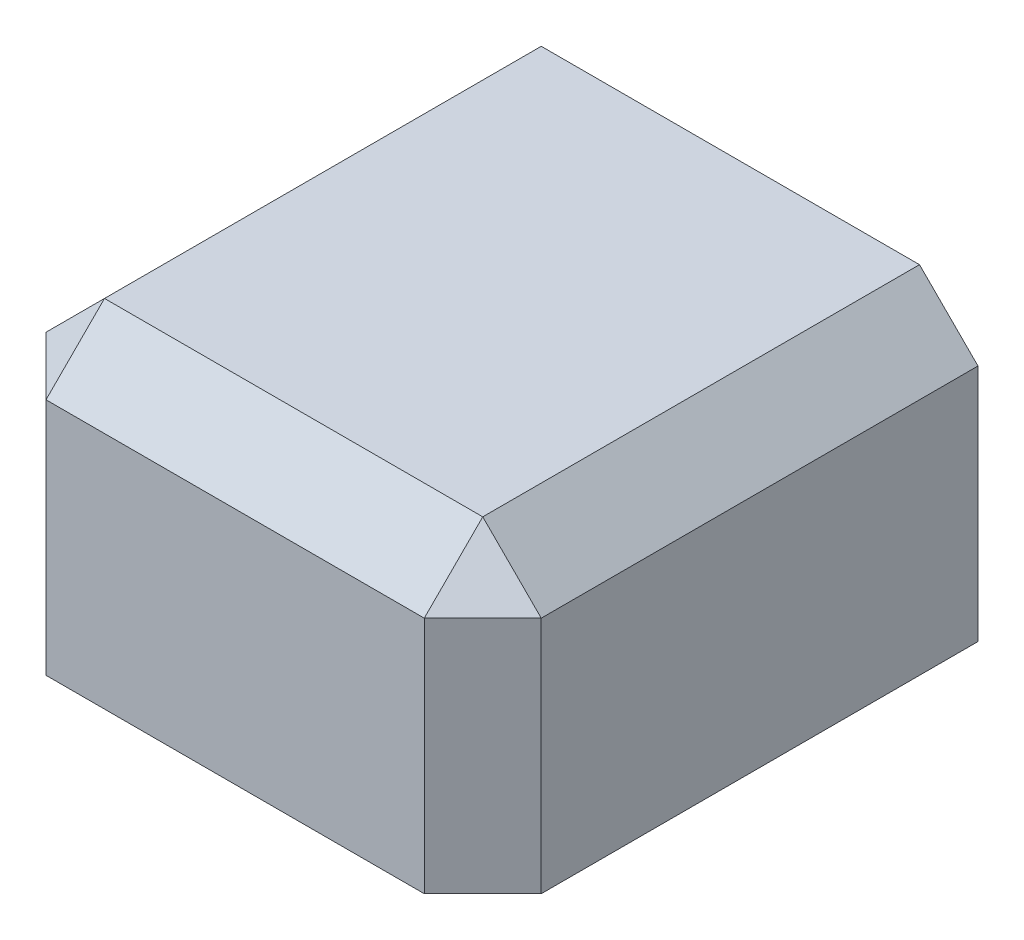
ISO-10303-21;
HEADER;
FILE_DESCRIPTION(('STEP AP214'),'2;1');
FILE_NAME('part.step','',(''),(''),'','','');
FILE_SCHEMA(('AUTOMOTIVE_DESIGN { 1 0 10303 214 1 1 1 1 }'));
ENDSEC;
DATA;
#1=APPLICATION_CONTEXT('core data for automotive mechanical design processes');
#2=APPLICATION_PROTOCOL_DEFINITION('international standard','automotive_design',2000,#1);
#3=PRODUCT_CONTEXT('',#1,'mechanical');
#4=PRODUCT('Part','Part','',(#3));
#5=PRODUCT_RELATED_PRODUCT_CATEGORY('part','',(#4));
#6=PRODUCT_DEFINITION_FORMATION('','',#4);
#7=PRODUCT_DEFINITION_CONTEXT('part definition',#1,'design');
#8=PRODUCT_DEFINITION('design','',#6,#7);
#9=PRODUCT_DEFINITION_SHAPE('','',#8);
#10=(LENGTH_UNIT() NAMED_UNIT(*) SI_UNIT(.MILLI.,.METRE.));
#11=(NAMED_UNIT(*) PLANE_ANGLE_UNIT() SI_UNIT($,.RADIAN.));
#12=(NAMED_UNIT(*) SI_UNIT($,.STERADIAN.) SOLID_ANGLE_UNIT());
#13=UNCERTAINTY_MEASURE_WITH_UNIT(LENGTH_MEASURE(1.E-05),#10,'distance_accuracy_value','');
#14=(GEOMETRIC_REPRESENTATION_CONTEXT(3) GLOBAL_UNCERTAINTY_ASSIGNED_CONTEXT((#13)) GLOBAL_UNIT_ASSIGNED_CONTEXT((#10,
#11,#12)) REPRESENTATION_CONTEXT('',''));
#15=CARTESIAN_POINT('',(0.,0.,0.));
#16=DIRECTION('',(0.,0.,1.));
#17=DIRECTION('',(1.,0.,0.));
#18=AXIS2_PLACEMENT_3D('',#15,#16,#17);
#19=CARTESIAN_POINT('',(-63.5,76.2,-63.5));
#20=DIRECTION('',(0.,0.,1.));
#21=DIRECTION('',(1.,0.,0.));
#22=AXIS2_PLACEMENT_3D('',#19,#20,#21);
#23=PLANE('',#22);
#24=DIRECTION('',(-0.258819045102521,-0.965925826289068,0.));
#25=VECTOR('',#24,1.);
#26=CARTESIAN_POINT('',(-14.826846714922,63.1580678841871,-63.5));
#27=LINE('',#26,#25);
#28=CARTESIAN_POINT('',(-31.75,0.,-63.5));
#29=VERTEX_POINT('',#28);
#30=CARTESIAN_POINT('',(-26.6455678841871,19.05,-63.5));
#31=VERTEX_POINT('',#30);
#32=EDGE_CURVE('E186',#29,#31,#27,.F.);
#33=ORIENTED_EDGE('',*,*,#32,.F.);
#34=DIRECTION('',(-1.,0.,0.));
#35=VECTOR('',#34,1.);
#36=CARTESIAN_POINT('',(-63.5,0.,-63.5));
#37=LINE('',#36,#35);
#38=CARTESIAN_POINT('',(-63.5,0.,-63.5));
#39=VERTEX_POINT('',#38);
#40=EDGE_CURVE('E163',#29,#39,#37,.T.);
#41=ORIENTED_EDGE('',*,*,#40,.T.);
#42=DIRECTION('',(0.,-1.,0.));
#43=VECTOR('',#42,1.);
#44=CARTESIAN_POINT('',(-63.5,76.2,-63.5));
#45=LINE('',#44,#43);
#46=CARTESIAN_POINT('',(-63.5,61.2,-63.5));
#47=VERTEX_POINT('',#46);
#48=EDGE_CURVE('E216',#47,#39,#45,.T.);
#49=ORIENTED_EDGE('',*,*,#48,.F.);
#50=DIRECTION('',(0.707106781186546,0.70710678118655,0.));
#51=VECTOR('',#50,1.);
#52=CARTESIAN_POINT('',(-48.5000000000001,76.2,-63.5));
#53=LINE('',#52,#51);
#54=CARTESIAN_POINT('',(-48.5000000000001,76.2,-63.5));
#55=VERTEX_POINT('',#54);
#56=EDGE_CURVE('E189',#47,#55,#53,.T.);
#57=ORIENTED_EDGE('',*,*,#56,.T.);
#58=DIRECTION('',(-1.,0.,0.));
#59=VECTOR('',#58,1.);
#60=CARTESIAN_POINT('',(-63.5,76.2,-63.5));
#61=LINE('',#60,#59);
#62=CARTESIAN_POINT('',(48.5,76.2,-63.5));
#63=VERTEX_POINT('',#62);
#64=EDGE_CURVE('E219',#63,#55,#61,.T.);
#65=ORIENTED_EDGE('',*,*,#64,.F.);
#66=DIRECTION('',(0.707106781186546,-0.70710678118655,0.));
#67=VECTOR('',#66,1.);
#68=CARTESIAN_POINT('',(48.5,76.2,-63.5));
#69=LINE('',#68,#67);
#70=CARTESIAN_POINT('',(63.5,61.2,-63.5));
#71=VERTEX_POINT('',#70);
#72=EDGE_CURVE('E191',#63,#71,#69,.T.);
#73=ORIENTED_EDGE('',*,*,#72,.T.);
#74=DIRECTION('',(0.,-1.,0.));
#75=VECTOR('',#74,1.);
#76=CARTESIAN_POINT('',(63.5,76.2,-63.5));
#77=LINE('',#76,#75);
#78=CARTESIAN_POINT('',(63.5,0.,-63.5));
#79=VERTEX_POINT('',#78);
#80=EDGE_CURVE('E214',#71,#79,#77,.T.);
#81=ORIENTED_EDGE('',*,*,#80,.T.);
#82=CARTESIAN_POINT('',(31.75,0.,-63.5));
#83=VERTEX_POINT('',#82);
#84=EDGE_CURVE('E226',#79,#83,#37,.T.);
#85=ORIENTED_EDGE('',*,*,#84,.T.);
#86=DIRECTION('',(-0.258819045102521,0.965925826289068,0.));
#87=VECTOR('',#86,1.);
#88=CARTESIAN_POINT('',(6.3194598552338,94.9080678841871,-63.5));
#89=LINE('',#88,#87);
#90=CARTESIAN_POINT('',(26.8939654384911,18.1229677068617,-63.5));
#91=VERTEX_POINT('',#90);
#92=EDGE_CURVE('E58',#91,#83,#89,.F.);
#93=ORIENTED_EDGE('',*,*,#92,.F.);
#94=DIRECTION('',(0.999682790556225,-0.0251856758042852,0.));
#95=VECTOR('',#94,1.);
#96=CARTESIAN_POINT('',(-64.904906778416,20.4357179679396,-63.5));
#97=LINE('',#96,#95);
#98=CARTESIAN_POINT('',(-9.90227687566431,19.05,-63.5000000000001));
#99=VERTEX_POINT('',#98);
#100=EDGE_CURVE('E51',#99,#91,#97,.T.);
#101=ORIENTED_EDGE('',*,*,#100,.F.);
#102=DIRECTION('',(1.,0.,0.));
#103=VECTOR('',#102,1.);
#104=CARTESIAN_POINT('',(-63.5,19.05,-63.5));
#105=LINE('',#104,#103);
#106=EDGE_CURVE('E11',#31,#99,#105,.T.);
#107=ORIENTED_EDGE('',*,*,#106,.F.);
#108=EDGE_LOOP('',(#33,#41,#49,#57,#65,#73,#81,#85,#93,#101,#107));
#109=FACE_BOUND('',#108,.T.);
#110=ADVANCED_FACE('F42',(#109),#23,.F.);
#111=CARTESIAN_POINT('',(0.,0.,0.));
#112=DIRECTION('',(0.,1.,0.));
#113=DIRECTION('',(0.,0.,1.));
#114=AXIS2_PLACEMENT_3D('',#111,#112,#113);
#115=PLANE('',#114);
#116=DIRECTION('',(0.,0.,1.));
#117=VECTOR('',#116,1.);
#118=CARTESIAN_POINT('',(-31.75,0.,0.));
#119=LINE('',#118,#117);
#120=CARTESIAN_POINT('',(-31.75,0.,0.));
#121=VERTEX_POINT('',#120);
#122=EDGE_CURVE('E143',#121,#29,#119,.F.);
#123=ORIENTED_EDGE('',*,*,#122,.F.);
#124=CARTESIAN_POINT('',(0.,0.,0.));
#125=DIRECTION('',(0.,1.,0.));
#126=DIRECTION('',(1.,0.,0.));
#127=AXIS2_PLACEMENT_3D('',#124,#125,#126);
#128=CIRCLE('',#127,31.75);
#129=CARTESIAN_POINT('',(31.75,0.,0.));
#130=VERTEX_POINT('',#129);
#131=EDGE_CURVE('E153',#121,#130,#128,.T.);
#132=ORIENTED_EDGE('',*,*,#131,.T.);
#133=DIRECTION('',(0.,0.,-1.));
#134=VECTOR('',#133,1.);
#135=CARTESIAN_POINT('',(31.75,0.,0.));
#136=LINE('',#135,#134);
#137=EDGE_CURVE('E157',#130,#83,#136,.T.);
#138=ORIENTED_EDGE('',*,*,#137,.T.);
#139=ORIENTED_EDGE('',*,*,#84,.F.);
#140=DIRECTION('',(0.,0.,-1.));
#141=VECTOR('',#140,1.);
#142=CARTESIAN_POINT('',(63.5,0.,-63.5));
#143=LINE('',#142,#141);
#144=CARTESIAN_POINT('',(63.5,0.,48.4999999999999));
#145=VERTEX_POINT('',#144);
#146=EDGE_CURVE('E171',#145,#79,#143,.T.);
#147=ORIENTED_EDGE('',*,*,#146,.F.);
#148=DIRECTION('',(0.707106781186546,0.,-0.707106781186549));
#149=VECTOR('',#148,1.);
#150=CARTESIAN_POINT('',(63.5,0.,48.4999999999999));
#151=LINE('',#150,#149);
#152=CARTESIAN_POINT('',(48.5,0.,63.5));
#153=VERTEX_POINT('',#152);
#154=EDGE_CURVE('E205',#145,#153,#151,.F.);
#155=ORIENTED_EDGE('',*,*,#154,.T.);
#156=DIRECTION('',(1.,0.,0.));
#157=VECTOR('',#156,1.);
#158=CARTESIAN_POINT('',(-63.5,0.,63.5));
#159=LINE('',#158,#157);
#160=CARTESIAN_POINT('',(-48.5,0.,63.5));
#161=VERTEX_POINT('',#160);
#162=EDGE_CURVE('E220',#161,#153,#159,.T.);
#163=ORIENTED_EDGE('',*,*,#162,.F.);
#164=DIRECTION('',(0.707106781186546,0.,0.707106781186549));
#165=VECTOR('',#164,1.);
#166=CARTESIAN_POINT('',(-48.5,0.,63.5));
#167=LINE('',#166,#165);
#168=CARTESIAN_POINT('',(-63.5,0.,48.4999999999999));
#169=VERTEX_POINT('',#168);
#170=EDGE_CURVE('E203',#161,#169,#167,.F.);
#171=ORIENTED_EDGE('',*,*,#170,.T.);
#172=DIRECTION('',(0.,0.,1.));
#173=VECTOR('',#172,1.);
#174=CARTESIAN_POINT('',(-63.5,0.,-63.5));
#175=LINE('',#174,#173);
#176=EDGE_CURVE('E223',#39,#169,#175,.T.);
#177=ORIENTED_EDGE('',*,*,#176,.F.);
#178=ORIENTED_EDGE('',*,*,#40,.F.);
#179=EDGE_LOOP('',(#123,#132,#138,#139,#147,#155,#163,#171,#177,#178));
#180=FACE_BOUND('',#179,.T.);
#181=ADVANCED_FACE('F161',(#180),#115,.F.);
#182=CARTESIAN_POINT('',(63.5,76.2,-63.5));
#183=DIRECTION('',(-1.,0.,0.));
#184=DIRECTION('',(0.,0.,1.));
#185=AXIS2_PLACEMENT_3D('',#182,#183,#184);
#186=PLANE('',#185);
#187=DIRECTION('',(0.,0.,1.));
#188=VECTOR('',#187,1.);
#189=CARTESIAN_POINT('',(63.5,61.2,63.5));
#190=LINE('',#189,#188);
#191=CARTESIAN_POINT('',(63.5,61.2,48.4999999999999));
#192=VERTEX_POINT('',#191);
#193=EDGE_CURVE('E66',#71,#192,#190,.T.);
#194=ORIENTED_EDGE('',*,*,#193,.T.);
#195=DIRECTION('',(0.,-1.,0.));
#196=VECTOR('',#195,1.);
#197=CARTESIAN_POINT('',(63.5,76.2,48.4999999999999));
#198=LINE('',#197,#196);
#199=EDGE_CURVE('E164',#192,#145,#198,.T.);
#200=ORIENTED_EDGE('',*,*,#199,.T.);
#201=ORIENTED_EDGE('',*,*,#146,.T.);
#202=ORIENTED_EDGE('',*,*,#80,.F.);
#203=EDGE_LOOP('',(#194,#200,#201,#202));
#204=FACE_BOUND('',#203,.T.);
#205=ADVANCED_FACE('F251',(#204),#186,.F.);
#206=CARTESIAN_POINT('',(-63.5,76.2,-63.5));
#207=DIRECTION('',(1.,0.,0.));
#208=DIRECTION('',(0.,0.,-1.));
#209=AXIS2_PLACEMENT_3D('',#206,#207,#208);
#210=PLANE('',#209);
#211=ORIENTED_EDGE('',*,*,#176,.T.);
#212=DIRECTION('',(0.,1.,0.));
#213=VECTOR('',#212,1.);
#214=CARTESIAN_POINT('',(-63.5,76.2,48.4999999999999));
#215=LINE('',#214,#213);
#216=CARTESIAN_POINT('',(-63.5,61.2,48.4999999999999));
#217=VERTEX_POINT('',#216);
#218=EDGE_CURVE('E199',#169,#217,#215,.T.);
#219=ORIENTED_EDGE('',*,*,#218,.T.);
#220=DIRECTION('',(0.,0.,-1.));
#221=VECTOR('',#220,1.);
#222=CARTESIAN_POINT('',(-63.5,61.2,-63.5));
#223=LINE('',#222,#221);
#224=EDGE_CURVE('E201',#217,#47,#223,.T.);
#225=ORIENTED_EDGE('',*,*,#224,.T.);
#226=ORIENTED_EDGE('',*,*,#48,.T.);
#227=EDGE_LOOP('',(#211,#219,#225,#226));
#228=FACE_BOUND('',#227,.T.);
#229=ADVANCED_FACE('F268',(#228),#210,.F.);
#230=CARTESIAN_POINT('',(-63.5,76.2,63.5));
#231=DIRECTION('',(0.,0.,-1.));
#232=DIRECTION('',(-1.,0.,0.));
#233=AXIS2_PLACEMENT_3D('',#230,#231,#232);
#234=PLANE('',#233);
#235=DIRECTION('',(-1.,0.,0.));
#236=VECTOR('',#235,1.);
#237=CARTESIAN_POINT('',(-63.5,61.2,63.5));
#238=LINE('',#237,#236);
#239=CARTESIAN_POINT('',(48.5,61.2,63.5));
#240=VERTEX_POINT('',#239);
#241=CARTESIAN_POINT('',(-48.5,61.2,63.5));
#242=VERTEX_POINT('',#241);
#243=EDGE_CURVE('E210',#240,#242,#238,.T.);
#244=ORIENTED_EDGE('',*,*,#243,.T.);
#245=DIRECTION('',(0.,-1.,0.));
#246=VECTOR('',#245,1.);
#247=CARTESIAN_POINT('',(-48.5,76.2,63.5));
#248=LINE('',#247,#246);
#249=EDGE_CURVE('E207',#242,#161,#248,.T.);
#250=ORIENTED_EDGE('',*,*,#249,.T.);
#251=ORIENTED_EDGE('',*,*,#162,.T.);
#252=DIRECTION('',(0.,1.,0.));
#253=VECTOR('',#252,1.);
#254=CARTESIAN_POINT('',(48.5,76.2,63.5));
#255=LINE('',#254,#253);
#256=EDGE_CURVE('E212',#153,#240,#255,.T.);
#257=ORIENTED_EDGE('',*,*,#256,.T.);
#258=EDGE_LOOP('',(#244,#250,#251,#257));
#259=FACE_BOUND('',#258,.T.);
#260=ADVANCED_FACE('F261',(#259),#234,.F.);
#261=CARTESIAN_POINT('',(0.,76.2,0.));
#262=DIRECTION('',(0.,1.,0.));
#263=DIRECTION('',(0.,0.,1.));
#264=AXIS2_PLACEMENT_3D('',#261,#262,#263);
#265=PLANE('',#264);
#266=ORIENTED_EDGE('',*,*,#64,.T.);
#267=DIRECTION('',(0.,0.,1.));
#268=VECTOR('',#267,1.);
#269=CARTESIAN_POINT('',(-48.5,76.2,63.5));
#270=LINE('',#269,#268);
#271=CARTESIAN_POINT('',(-48.5,76.2,48.5));
#272=VERTEX_POINT('',#271);
#273=EDGE_CURVE('E193',#55,#272,#270,.T.);
#274=ORIENTED_EDGE('',*,*,#273,.T.);
#275=DIRECTION('',(1.,0.,0.));
#276=VECTOR('',#275,1.);
#277=CARTESIAN_POINT('',(63.5,76.2,48.5));
#278=LINE('',#277,#276);
#279=CARTESIAN_POINT('',(48.5,76.2,48.5));
#280=VERTEX_POINT('',#279);
#281=EDGE_CURVE('E195',#272,#280,#278,.T.);
#282=ORIENTED_EDGE('',*,*,#281,.T.);
#283=DIRECTION('',(0.,0.,-1.));
#284=VECTOR('',#283,1.);
#285=CARTESIAN_POINT('',(48.5,76.2,-63.5));
#286=LINE('',#285,#284);
#287=EDGE_CURVE('E197',#280,#63,#286,.T.);
#288=ORIENTED_EDGE('',*,*,#287,.T.);
#289=EDGE_LOOP('',(#266,#274,#282,#288));
#290=FACE_BOUND('',#289,.T.);
#291=ADVANCED_FACE('F342',(#290),#265,.T.);
#292=CARTESIAN_POINT('',(48.5,76.2,0.));
#293=DIRECTION('',(0.707106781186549,0.707106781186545,0.));
#294=DIRECTION('',(0.,0.,1.));
#295=AXIS2_PLACEMENT_3D('',#292,#293,#294);
#296=PLANE('',#295);
#297=ORIENTED_EDGE('',*,*,#72,.F.);
#298=ORIENTED_EDGE('',*,*,#287,.F.);
#299=DIRECTION('',(-0.707106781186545,0.707106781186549,0.));
#300=VECTOR('',#299,1.);
#301=CARTESIAN_POINT('',(48.5,76.2,48.5));
#302=LINE('',#301,#300);
#303=EDGE_CURVE('E168',#192,#280,#302,.T.);
#304=ORIENTED_EDGE('',*,*,#303,.F.);
#305=ORIENTED_EDGE('',*,*,#193,.F.);
#306=EDGE_LOOP('',(#297,#298,#304,#305));
#307=FACE_BOUND('',#306,.T.);
#308=ADVANCED_FACE('F45',(#307),#296,.T.);
#309=CARTESIAN_POINT('',(63.5,76.2,48.4999999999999));
#310=DIRECTION('',(-0.707106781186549,0.,-0.707106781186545));
#311=DIRECTION('',(0.,-1.,0.));
#312=AXIS2_PLACEMENT_3D('',#309,#310,#311);
#313=PLANE('',#312);
#314=ORIENTED_EDGE('',*,*,#154,.F.);
#315=ORIENTED_EDGE('',*,*,#199,.F.);
#316=DIRECTION('',(-0.707106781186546,0.,0.707106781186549));
#317=VECTOR('',#316,1.);
#318=CARTESIAN_POINT('',(56.,61.2,56.));
#319=LINE('',#318,#317);
#320=EDGE_CURVE('E172',#240,#192,#319,.F.);
#321=ORIENTED_EDGE('',*,*,#320,.F.);
#322=ORIENTED_EDGE('',*,*,#256,.F.);
#323=EDGE_LOOP('',(#314,#315,#321,#322));
#324=FACE_BOUND('',#323,.T.);
#325=ADVANCED_FACE('F256',(#324),#313,.F.);
#326=CARTESIAN_POINT('',(48.5,76.2,48.5));
#327=DIRECTION('',(0.577350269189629,0.577350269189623,0.577350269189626));
#328=DIRECTION('',(0.707106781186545,0.,-0.707106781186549));
#329=AXIS2_PLACEMENT_3D('',#326,#327,#328);
#330=PLANE('',#329);
#331=ORIENTED_EDGE('',*,*,#320,.T.);
#332=ORIENTED_EDGE('',*,*,#303,.T.);
#333=DIRECTION('',(0.,-0.707106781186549,0.707106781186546));
#334=VECTOR('',#333,1.);
#335=CARTESIAN_POINT('',(48.5,76.2,48.5));
#336=LINE('',#335,#334);
#337=EDGE_CURVE('E175',#240,#280,#336,.F.);
#338=ORIENTED_EDGE('',*,*,#337,.F.);
#339=EDGE_LOOP('',(#331,#332,#338));
#340=FACE_BOUND('',#339,.T.);
#341=ADVANCED_FACE('F330',(#340),#330,.T.);
#342=CARTESIAN_POINT('',(-48.5000000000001,76.2,0.));
#343=DIRECTION('',(-0.707106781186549,0.707106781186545,0.));
#344=DIRECTION('',(0.,0.,-1.));
#345=AXIS2_PLACEMENT_3D('',#342,#343,#344);
#346=PLANE('',#345);
#347=ORIENTED_EDGE('',*,*,#56,.F.);
#348=ORIENTED_EDGE('',*,*,#224,.F.);
#349=DIRECTION('',(-0.707106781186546,-0.707106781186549,0.));
#350=VECTOR('',#349,1.);
#351=CARTESIAN_POINT('',(-63.5,61.2,48.4999999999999));
#352=LINE('',#351,#350);
#353=EDGE_CURVE('E178',#272,#217,#352,.T.);
#354=ORIENTED_EDGE('',*,*,#353,.F.);
#355=ORIENTED_EDGE('',*,*,#273,.F.);
#356=EDGE_LOOP('',(#347,#348,#354,#355));
#357=FACE_BOUND('',#356,.T.);
#358=ADVANCED_FACE('F279',(#357),#346,.T.);
#359=CARTESIAN_POINT('',(0.,76.2,48.5));
#360=DIRECTION('',(0.,0.707106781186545,0.707106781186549));
#361=DIRECTION('',(-1.,0.,0.));
#362=AXIS2_PLACEMENT_3D('',#359,#360,#361);
#363=PLANE('',#362);
#364=ORIENTED_EDGE('',*,*,#337,.T.);
#365=ORIENTED_EDGE('',*,*,#281,.F.);
#366=DIRECTION('',(0.,0.707106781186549,-0.707106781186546));
#367=VECTOR('',#366,1.);
#368=CARTESIAN_POINT('',(-48.5,68.7,56.));
#369=LINE('',#368,#367);
#370=EDGE_CURVE('E181',#242,#272,#369,.T.);
#371=ORIENTED_EDGE('',*,*,#370,.F.);
#372=ORIENTED_EDGE('',*,*,#243,.F.);
#373=EDGE_LOOP('',(#364,#365,#371,#372));
#374=FACE_BOUND('',#373,.T.);
#375=ADVANCED_FACE('F318',(#374),#363,.T.);
#376=CARTESIAN_POINT('',(-63.5,61.2,48.4999999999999));
#377=DIRECTION('',(-0.577350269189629,0.577350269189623,0.577350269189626));
#378=DIRECTION('',(0.707106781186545,0.,0.707106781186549));
#379=AXIS2_PLACEMENT_3D('',#376,#377,#378);
#380=PLANE('',#379);
#381=ORIENTED_EDGE('',*,*,#370,.T.);
#382=ORIENTED_EDGE('',*,*,#353,.T.);
#383=DIRECTION('',(-0.707106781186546,0.,-0.707106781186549));
#384=VECTOR('',#383,1.);
#385=CARTESIAN_POINT('',(-63.5,61.2,48.4999999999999));
#386=LINE('',#385,#384);
#387=EDGE_CURVE('E184',#242,#217,#386,.T.);
#388=ORIENTED_EDGE('',*,*,#387,.F.);
#389=EDGE_LOOP('',(#381,#382,#388));
#390=FACE_BOUND('',#389,.T.);
#391=ADVANCED_FACE('F274',(#390),#380,.T.);
#392=CARTESIAN_POINT('',(-48.5,76.2,63.5));
#393=DIRECTION('',(0.707106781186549,0.,-0.707106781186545));
#394=DIRECTION('',(0.,-1.,0.));
#395=AXIS2_PLACEMENT_3D('',#392,#393,#394);
#396=PLANE('',#395);
#397=ORIENTED_EDGE('',*,*,#387,.T.);
#398=ORIENTED_EDGE('',*,*,#218,.F.);
#399=ORIENTED_EDGE('',*,*,#170,.F.);
#400=ORIENTED_EDGE('',*,*,#249,.F.);
#401=EDGE_LOOP('',(#397,#398,#399,#400));
#402=FACE_BOUND('',#401,.T.);
#403=ADVANCED_FACE('F271',(#402),#396,.F.);
#404=CARTESIAN_POINT('',(-88.8718839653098,19.05,-119.16190870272));
#405=DIRECTION('',(0.,-1.,0.));
#406=DIRECTION('',(-1.,0.,0.));
#407=AXIS2_PLACEMENT_3D('',#404,#405,#406);
#408=PLANE('',#407);
#409=ORIENTED_EDGE('',*,*,#106,.T.);
#410=DIRECTION('',(-0.993440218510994,0.,-0.114352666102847));
#411=VECTOR('',#410,1.);
#412=CARTESIAN_POINT('',(-94.1625694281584,19.05,-73.1990125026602));
#413=LINE('',#412,#411);
#414=CARTESIAN_POINT('',(26.6455678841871,19.05,-59.2930599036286));
#415=VERTEX_POINT('',#414);
#416=EDGE_CURVE('E149',#415,#99,#413,.T.);
#417=ORIENTED_EDGE('',*,*,#416,.F.);
#418=DIRECTION('',(0.,0.,1.));
#419=VECTOR('',#418,1.);
#420=CARTESIAN_POINT('',(26.6455678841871,19.05,-119.16190870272));
#421=LINE('',#420,#419);
#422=CARTESIAN_POINT('',(26.6455678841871,19.05,0.));
#423=VERTEX_POINT('',#422);
#424=EDGE_CURVE('E236',#423,#415,#421,.F.);
#425=ORIENTED_EDGE('',*,*,#424,.F.);
#426=CARTESIAN_POINT('',(0.,19.05,0.));
#427=DIRECTION('',(0.,-1.,0.));
#428=DIRECTION('',(-1.,0.,0.));
#429=AXIS2_PLACEMENT_3D('',#426,#427,#428);
#430=CIRCLE('',#429,26.6455678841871);
#431=CARTESIAN_POINT('',(-26.6455678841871,19.05,0.));
#432=VERTEX_POINT('',#431);
#433=EDGE_CURVE('E239',#432,#423,#430,.F.);
#434=ORIENTED_EDGE('',*,*,#433,.F.);
#435=DIRECTION('',(0.,0.,-1.));
#436=VECTOR('',#435,1.);
#437=CARTESIAN_POINT('',(-26.6455678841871,19.05,-119.16190870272));
#438=LINE('',#437,#436);
#439=EDGE_CURVE('E146',#31,#432,#438,.F.);
#440=ORIENTED_EDGE('',*,*,#439,.F.);
#441=EDGE_LOOP('',(#409,#417,#425,#434,#440));
#442=FACE_BOUND('',#441,.T.);
#443=ADVANCED_FACE('F282',(#442),#408,.T.);
#444=CARTESIAN_POINT('',(306.892985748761,1.52399999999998,-107.109230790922));
#445=DIRECTION('',(-0.0246036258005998,-0.976579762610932,0.213744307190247));
#446=DIRECTION('',(0.,-0.213809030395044,-0.97687547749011));
#447=AXIS2_PLACEMENT_3D('',#444,#445,#446);
#448=PLANE('',#447);
#449=ORIENTED_EDGE('',*,*,#100,.T.);
#450=DIRECTION('',(0.0575657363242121,-0.214838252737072,-0.974951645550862));
#451=VECTOR('',#450,1.);
#452=CARTESIAN_POINT('',(23.5703281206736,30.5269510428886,-7.20981977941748));
#453=LINE('',#452,#451);
#454=EDGE_CURVE('E158',#91,#415,#453,.F.);
#455=ORIENTED_EDGE('',*,*,#454,.T.);
#456=ORIENTED_EDGE('',*,*,#416,.T.);
#457=EDGE_LOOP('',(#449,#455,#456));
#458=FACE_BOUND('',#457,.T.);
#459=ADVANCED_FACE('F287',(#458),#448,.T.);
#460=CARTESIAN_POINT('',(-31.75,0.,-69.85));
#461=DIRECTION('',(-0.965925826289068,0.258819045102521,0.));
#462=DIRECTION('',(0.258819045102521,0.965925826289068,0.));
#463=AXIS2_PLACEMENT_3D('',#460,#461,#462);
#464=PLANE('',#463);
#465=ORIENTED_EDGE('',*,*,#32,.T.);
#466=ORIENTED_EDGE('',*,*,#439,.T.);
#467=DIRECTION('',(-0.258819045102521,-0.965925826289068,0.));
#468=VECTOR('',#467,1.);
#469=CARTESIAN_POINT('',(-31.75,0.,0.));
#470=LINE('',#469,#468);
#471=EDGE_CURVE('E139',#432,#121,#470,.T.);
#472=ORIENTED_EDGE('',*,*,#471,.T.);
#473=ORIENTED_EDGE('',*,*,#122,.T.);
#474=EDGE_LOOP('',(#465,#466,#472,#473));
#475=FACE_BOUND('',#474,.T.);
#476=ADVANCED_FACE('F141',(#475),#464,.F.);
#477=CARTESIAN_POINT('',(31.75,0.,0.));
#478=DIRECTION('',(0.965925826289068,0.258819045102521,0.));
#479=DIRECTION('',(0.258819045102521,-0.965925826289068,0.));
#480=AXIS2_PLACEMENT_3D('',#477,#478,#479);
#481=PLANE('',#480);
#482=ORIENTED_EDGE('',*,*,#92,.T.);
#483=ORIENTED_EDGE('',*,*,#137,.F.);
#484=DIRECTION('',(0.258819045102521,-0.965925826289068,0.));
#485=VECTOR('',#484,1.);
#486=CARTESIAN_POINT('',(31.75,0.,0.));
#487=LINE('',#486,#485);
#488=EDGE_CURVE('E150',#423,#130,#487,.T.);
#489=ORIENTED_EDGE('',*,*,#488,.F.);
#490=ORIENTED_EDGE('',*,*,#424,.T.);
#491=ORIENTED_EDGE('',*,*,#454,.F.);
#492=EDGE_LOOP('',(#482,#483,#489,#490,#491));
#493=FACE_BOUND('',#492,.T.);
#494=ADVANCED_FACE('F285',(#493),#481,.F.);
#495=CARTESIAN_POINT('',(0.,0.,0.));
#496=DIRECTION('',(0.,-1.,0.));
#497=DIRECTION('',(1.,0.,0.));
#498=AXIS2_PLACEMENT_3D('',#495,#496,#497);
#499=CONICAL_SURFACE('',#498,31.75,0.26179938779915);
#500=ORIENTED_EDGE('',*,*,#131,.F.);
#501=ORIENTED_EDGE('',*,*,#471,.F.);
#502=ORIENTED_EDGE('',*,*,#433,.T.);
#503=ORIENTED_EDGE('',*,*,#488,.T.);
#504=EDGE_LOOP('',(#500,#501,#502,#503));
#505=FACE_BOUND('',#504,.T.);
#506=ADVANCED_FACE('F154',(#505),#499,.F.);
#507=CLOSED_SHELL('',(#110,#181,#205,#229,#260,#291,#308,#325,#341,#358,#375,#391,#403,#443,
#459,#476,#494,#506));
#508=MANIFOLD_SOLID_BREP('B2',#507);
#509=ADVANCED_BREP_SHAPE_REPRESENTATION('',(#18,#508),#14);
#510=SHAPE_DEFINITION_REPRESENTATION(#9,#509);
ENDSEC;
END-ISO-10303-21;
